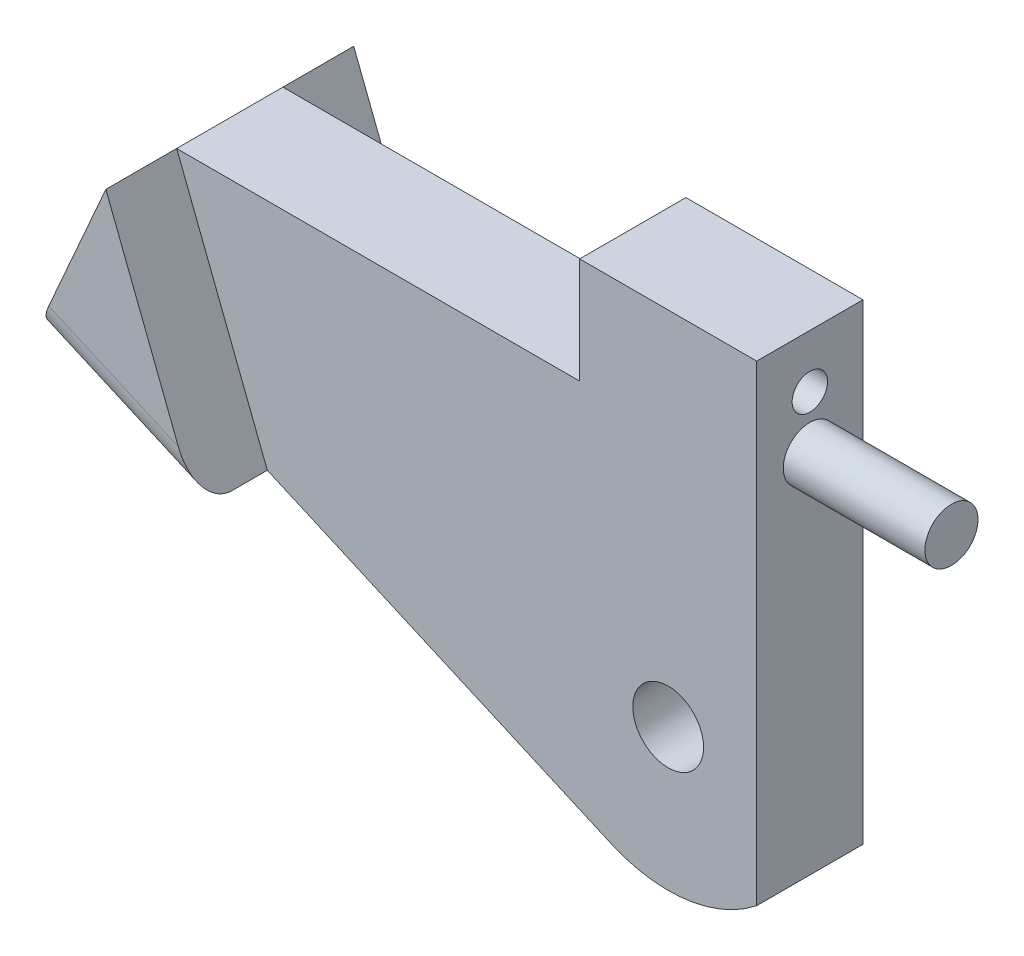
from build123d import *

# Parameters (mm, degrees)
EXTRUDE1_DEPTH     = 1.5
EXTRUDE3_DEPTH     = 3.5
SKETCH3_R          = 1
CUT_EXTRUDE1_DEPTH = 3.5
SKETCH4_R          = 0.5
CUT_EXTRUDE2_DEPTH = 22.324455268
SKETCH5_R          = 0.75
EXTRUDE2_DEPTH     = 4
FILLET1_R          = 1


with BuildPart() as part:
    # Sketch1 → Extrude1 (new, symmetric)
    with BuildSketch(Plane.XY):
        with BuildLine():
            Line((-2.5, 10.198039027), (2.5, 10.198039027))
            Line((2.5, 10.198039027), (2.5, -3.122498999))
            ThreePointArc((2.5, -3.122498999), (0.518922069, -3.966197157), (-1.612529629, -3.66056665))
            Line((-1.612529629, -3.66056665), (-15.897890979, 2.632330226))
            Line((-15.897890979, 2.632330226), (-13.882228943, 7.208038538))
            Line((-13.882228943, 7.208038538), (-2.5, 7.208038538))
            Line((-2.5, 7.208038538), (-2.5, 10.198039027))
        make_face()
    extrude(amount=EXTRUDE1_DEPTH, both=True)

    # Sketch6 → Extrude3 (add, symmetric)
    with BuildSketch(Plane.XY):
        Polygon((-13.882228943, 7.208038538), (-15.897890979, 2.632330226), (-11.322182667, 0.616668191), align=None)
    extrude(amount=EXTRUDE3_DEPTH, both=True)

    # Sketch3 → Cut-Extrude1 (cut, symmetric)
    with BuildSketch(Plane.XY):
        Circle(SKETCH3_R)
    extrude(amount=CUT_EXTRUDE1_DEPTH, both=True, mode=Mode.SUBTRACT)

    # Sketch4 → Cut-Extrude2 (cut, through all)
    with BuildSketch(Plane(origin=(2.5, 0, 0), x_dir=(0, 0, -1), z_dir=(1, 0, 0))):
        with Locations(Location((0, 8.698039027, 0), (0, 0, 90))):
            Circle(SKETCH4_R)
    extrude(amount=-CUT_EXTRUDE2_DEPTH, mode=Mode.SUBTRACT)

    # Sketch5 → Extrude2 (add)
    with BuildSketch(Plane(origin=(2.5, 0, 0), x_dir=(0, 0, -1), z_dir=(1, 0, 0))):
        with Locations(Location((0, 7.198039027, 0), (0, 0, 270))):
            Circle(SKETCH5_R)
    extrude(amount=EXTRUDE2_DEPTH)

    # Fillet1
    fillet1_edges = [part.edges().sort_by_distance(p)[0] for p in [
        (-13.610036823, 1.624499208, -3.5),
        (-13.610036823, 1.624499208, 3.5),
    ]]
    fillet(fillet1_edges, radius=FILLET1_R)


solid = part.part
